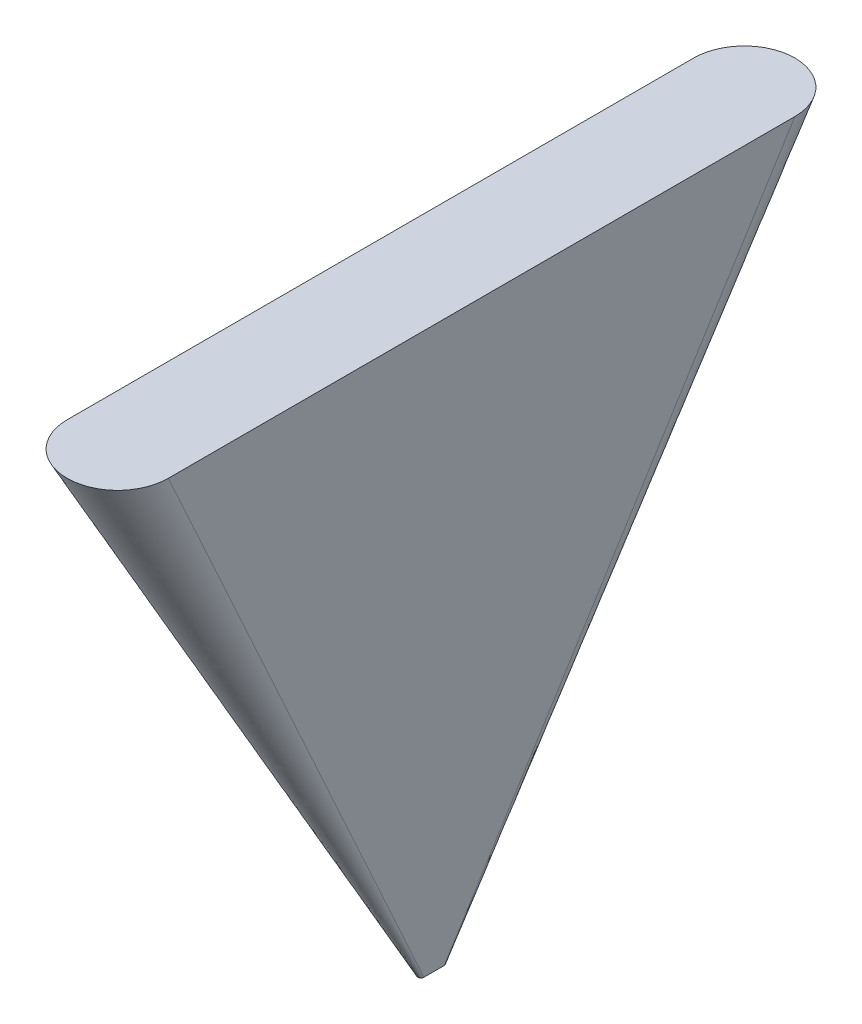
ISO-10303-21;
HEADER;
FILE_DESCRIPTION(('STEP AP214'),'2;1');
FILE_NAME('part.step','',(''),(''),'','','');
FILE_SCHEMA(('AUTOMOTIVE_DESIGN { 1 0 10303 214 1 1 1 1 }'));
ENDSEC;
DATA;
#1=APPLICATION_CONTEXT('core data for automotive mechanical design processes');
#2=APPLICATION_PROTOCOL_DEFINITION('international standard','automotive_design',2000,#1);
#3=PRODUCT_CONTEXT('',#1,'mechanical');
#4=PRODUCT('Part','Part','',(#3));
#5=PRODUCT_RELATED_PRODUCT_CATEGORY('part','',(#4));
#6=PRODUCT_DEFINITION_FORMATION('','',#4);
#7=PRODUCT_DEFINITION_CONTEXT('part definition',#1,'design');
#8=PRODUCT_DEFINITION('design','',#6,#7);
#9=PRODUCT_DEFINITION_SHAPE('','',#8);
#10=(LENGTH_UNIT() NAMED_UNIT(*) SI_UNIT(.MILLI.,.METRE.));
#11=(NAMED_UNIT(*) PLANE_ANGLE_UNIT() SI_UNIT($,.RADIAN.));
#12=(NAMED_UNIT(*) SI_UNIT($,.STERADIAN.) SOLID_ANGLE_UNIT());
#13=UNCERTAINTY_MEASURE_WITH_UNIT(LENGTH_MEASURE(1.E-05),#10,'distance_accuracy_value','');
#14=(GEOMETRIC_REPRESENTATION_CONTEXT(3) GLOBAL_UNCERTAINTY_ASSIGNED_CONTEXT((#13)) GLOBAL_UNIT_ASSIGNED_CONTEXT((#10,
#11,#12)) REPRESENTATION_CONTEXT('',''));
#15=CARTESIAN_POINT('',(0.,0.,0.));
#16=DIRECTION('',(0.,0.,1.));
#17=DIRECTION('',(1.,0.,0.));
#18=AXIS2_PLACEMENT_3D('',#15,#16,#17);
#19=CARTESIAN_POINT('',(0.,300.,-154.70508075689));
#20=DIRECTION('',(0.,1.,0.));
#21=DIRECTION('',(0.,0.,1.));
#22=AXIS2_PLACEMENT_3D('',#19,#20,#21);
#23=PLANE('',#22);
#24=CARTESIAN_POINT('',(0.,300.,-154.70508075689));
#25=DIRECTION('',(0.,1.,0.));
#26=DIRECTION('',(0.,0.,1.));
#27=AXIS2_PLACEMENT_3D('',#24,#25,#26);
#28=CIRCLE('',#27,25.);
#29=CARTESIAN_POINT('',(25.,300.,-154.70508075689));
#30=VERTEX_POINT('',#29);
#31=CARTESIAN_POINT('',(-25.,300.,-154.70508075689));
#32=VERTEX_POINT('',#31);
#33=EDGE_CURVE('E79',#30,#32,#28,.T.);
#34=ORIENTED_EDGE('',*,*,#33,.T.);
#35=DIRECTION('',(0.,0.,1.));
#36=VECTOR('',#35,1.);
#37=CARTESIAN_POINT('',(-25.,300.,154.705080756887));
#38=LINE('',#37,#36);
#39=CARTESIAN_POINT('',(-25.,300.,154.705080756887));
#40=VERTEX_POINT('',#39);
#41=EDGE_CURVE('E89',#32,#40,#38,.T.);
#42=ORIENTED_EDGE('',*,*,#41,.T.);
#43=CARTESIAN_POINT('',(0.,300.,154.705080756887));
#44=DIRECTION('',(0.,1.,0.));
#45=DIRECTION('',(0.,0.,1.));
#46=AXIS2_PLACEMENT_3D('',#43,#44,#45);
#47=CIRCLE('',#46,25.);
#48=CARTESIAN_POINT('',(25.0000000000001,300.,154.705080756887));
#49=VERTEX_POINT('',#48);
#50=EDGE_CURVE('E80',#40,#49,#47,.T.);
#51=ORIENTED_EDGE('',*,*,#50,.T.);
#52=DIRECTION('',(0.,0.,-1.));
#53=VECTOR('',#52,1.);
#54=CARTESIAN_POINT('',(25.,300.,-154.70508075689));
#55=LINE('',#54,#53);
#56=EDGE_CURVE('E77',#49,#30,#55,.T.);
#57=ORIENTED_EDGE('',*,*,#56,.T.);
#58=EDGE_LOOP('',(#34,#42,#51,#57));
#59=FACE_BOUND('',#58,.T.);
#60=ADVANCED_FACE('F33',(#59),#23,.T.);
#61=CARTESIAN_POINT('',(0.,0.,5.));
#62=DIRECTION('',(0.,-1.,0.));
#63=DIRECTION('',(0.,0.,-1.));
#64=AXIS2_PLACEMENT_3D('',#61,#62,#63);
#65=PLANE('',#64);
#66=CARTESIAN_POINT('',(0.,0.,5.));
#67=DIRECTION('',(0.,1.,0.));
#68=DIRECTION('',(0.,0.,-1.));
#69=AXIS2_PLACEMENT_3D('',#66,#67,#68);
#70=CIRCLE('',#69,1.5);
#71=CARTESIAN_POINT('',(-1.5,0.,5.));
#72=VERTEX_POINT('',#71);
#73=CARTESIAN_POINT('',(1.5,0.,5.));
#74=VERTEX_POINT('',#73);
#75=EDGE_CURVE('E37',#72,#74,#70,.T.);
#76=ORIENTED_EDGE('',*,*,#75,.F.);
#77=DIRECTION('',(0.,0.,1.));
#78=VECTOR('',#77,1.);
#79=CARTESIAN_POINT('',(-1.5,0.,5.));
#80=LINE('',#79,#78);
#81=CARTESIAN_POINT('',(-1.5,0.,-5.));
#82=VERTEX_POINT('',#81);
#83=EDGE_CURVE('E98',#82,#72,#80,.T.);
#84=ORIENTED_EDGE('',*,*,#83,.F.);
#85=CARTESIAN_POINT('',(0.,0.,-5.));
#86=DIRECTION('',(0.,1.,0.));
#87=DIRECTION('',(0.,0.,-1.));
#88=AXIS2_PLACEMENT_3D('',#85,#86,#87);
#89=CIRCLE('',#88,1.5);
#90=CARTESIAN_POINT('',(1.5,0.,-5.));
#91=VERTEX_POINT('',#90);
#92=EDGE_CURVE('E42',#91,#82,#89,.T.);
#93=ORIENTED_EDGE('',*,*,#92,.F.);
#94=DIRECTION('',(0.,0.,-1.));
#95=VECTOR('',#94,1.);
#96=CARTESIAN_POINT('',(1.5,0.,-5.));
#97=LINE('',#96,#95);
#98=EDGE_CURVE('E11',#74,#91,#97,.T.);
#99=ORIENTED_EDGE('',*,*,#98,.F.);
#100=EDGE_LOOP('',(#76,#84,#93,#99));
#101=FACE_BOUND('',#100,.T.);
#102=ADVANCED_FACE('F35',(#101),#65,.T.);
#103=CARTESIAN_POINT('',(1.5,0.,-5.));
#104=CARTESIAN_POINT('',(25.,300.,-154.70508075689));
#105=CARTESIAN_POINT('',(1.5,0.,-8.));
#106=CARTESIAN_POINT('',(25.,300.,-204.70508075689));
#107=CARTESIAN_POINT('',(-1.5,0.,-8.));
#108=CARTESIAN_POINT('',(-25.,300.,-204.70508075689));
#109=CARTESIAN_POINT('',(-1.5,0.,-5.));
#110=CARTESIAN_POINT('',(-25.,300.,-154.70508075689));
#111=(BOUNDED_SURFACE() B_SPLINE_SURFACE(3,1,((#103,#104),(#105,#106),(#107,#108),(#109,#110)),
.UNSPECIFIED.,.F.,.F.,.F.) B_SPLINE_SURFACE_WITH_KNOTS((4,4),(2,2),(0.,1.),(0.,1.),
.UNSPECIFIED.) GEOMETRIC_REPRESENTATION_ITEM() RATIONAL_B_SPLINE_SURFACE(((1.,1.),
(0.333333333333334,0.333333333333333),(0.333333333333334,0.333333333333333),(1.,1.))) REPRESENTATION_ITEM('') SURFACE());
#112=DIRECTION('',(-0.069919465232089,0.892588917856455,-0.445416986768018));
#113=VECTOR('',#112,1.);
#114=CARTESIAN_POINT('',(-13.25,150.,-79.8525403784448));
#115=LINE('',#114,#113);
#116=EDGE_CURVE('E88',#82,#32,#115,.T.);
#117=DIRECTION('',(-0.069919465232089,-0.892588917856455,0.445416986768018));
#118=VECTOR('',#117,1.);
#119=CARTESIAN_POINT('',(13.25,150.,-79.8525403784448));
#120=LINE('',#119,#118);
#121=EDGE_CURVE('E56',#30,#91,#120,.T.);
#122=ORIENTED_EDGE('',*,*,#92,.T.);
#123=ORIENTED_EDGE('',*,*,#116,.T.);
#124=ORIENTED_EDGE('',*,*,#33,.F.);
#125=ORIENTED_EDGE('',*,*,#121,.T.);
#126=EDGE_LOOP('',(#122,#123,#124,#125));
#127=FACE_BOUND('',#126,.T.);
#128=ADVANCED_FACE('F86',(#127),#111,.T.);
#129=CARTESIAN_POINT('',(-25.,300.,154.705080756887));
#130=DIRECTION('',(0.996945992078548,0.0780941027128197,0.));
#131=DIRECTION('',(-0.0780941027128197,0.996945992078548,0.));
#132=AXIS2_PLACEMENT_3D('',#129,#130,#131);
#133=PLANE('',#132);
#134=DIRECTION('',(-0.0699194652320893,0.892588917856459,0.445416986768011));
#135=VECTOR('',#134,1.);
#136=CARTESIAN_POINT('',(-1.5,0.,5.));
#137=LINE('',#136,#135);
#138=EDGE_CURVE('E92',#72,#40,#137,.T.);
#139=ORIENTED_EDGE('',*,*,#138,.T.);
#140=ORIENTED_EDGE('',*,*,#41,.F.);
#141=ORIENTED_EDGE('',*,*,#116,.F.);
#142=ORIENTED_EDGE('',*,*,#83,.T.);
#143=EDGE_LOOP('',(#139,#140,#141,#142));
#144=FACE_BOUND('',#143,.T.);
#145=ADVANCED_FACE('F107',(#144),#133,.F.);
#146=CARTESIAN_POINT('',(25.,300.,-154.70508075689));
#147=DIRECTION('',(-0.996945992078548,0.0780941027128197,0.));
#148=DIRECTION('',(-0.0780941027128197,-0.996945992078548,0.));
#149=AXIS2_PLACEMENT_3D('',#146,#147,#148);
#150=PLANE('',#149);
#151=ORIENTED_EDGE('',*,*,#121,.F.);
#152=ORIENTED_EDGE('',*,*,#56,.F.);
#153=DIRECTION('',(0.0699194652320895,0.892588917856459,0.445416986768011));
#154=VECTOR('',#153,1.);
#155=CARTESIAN_POINT('',(13.25,150.,79.8525403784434));
#156=LINE('',#155,#154);
#157=EDGE_CURVE('E83',#74,#49,#156,.T.);
#158=ORIENTED_EDGE('',*,*,#157,.F.);
#159=ORIENTED_EDGE('',*,*,#98,.T.);
#160=EDGE_LOOP('',(#151,#152,#158,#159));
#161=FACE_BOUND('',#160,.T.);
#162=ADVANCED_FACE('F91',(#161),#150,.F.);
#163=CARTESIAN_POINT('',(-1.5,0.,5.));
#164=CARTESIAN_POINT('',(-25.,300.,154.705080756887));
#165=CARTESIAN_POINT('',(-1.5,0.,8.));
#166=CARTESIAN_POINT('',(-25.,300.,204.705080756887));
#167=CARTESIAN_POINT('',(1.5,0.,8.));
#168=CARTESIAN_POINT('',(25.,300.,204.705080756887));
#169=CARTESIAN_POINT('',(1.5,0.,5.));
#170=CARTESIAN_POINT('',(25.0000000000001,300.,154.705080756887));
#171=(BOUNDED_SURFACE() B_SPLINE_SURFACE(3,1,((#163,#164),(#165,#166),(#167,#168),(#169,#170)),
.UNSPECIFIED.,.F.,.F.,.F.) B_SPLINE_SURFACE_WITH_KNOTS((4,4),(2,2),(0.,1.),(0.,1.),
.UNSPECIFIED.) GEOMETRIC_REPRESENTATION_ITEM() RATIONAL_B_SPLINE_SURFACE(((1.,1.),
(0.333333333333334,0.333333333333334),(0.333333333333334,0.333333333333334),(1.,1.))) REPRESENTATION_ITEM('') SURFACE());
#172=ORIENTED_EDGE('',*,*,#75,.T.);
#173=ORIENTED_EDGE('',*,*,#157,.T.);
#174=ORIENTED_EDGE('',*,*,#50,.F.);
#175=ORIENTED_EDGE('',*,*,#138,.F.);
#176=EDGE_LOOP('',(#172,#173,#174,#175));
#177=FACE_BOUND('',#176,.T.);
#178=ADVANCED_FACE('F103',(#177),#171,.T.);
#179=CLOSED_SHELL('',(#60,#102,#128,#145,#162,#178));
#180=MANIFOLD_SOLID_BREP('B2',#179);
#181=ADVANCED_BREP_SHAPE_REPRESENTATION('',(#18,#180),#14);
#182=SHAPE_DEFINITION_REPRESENTATION(#9,#181);
ENDSEC;
END-ISO-10303-21;
